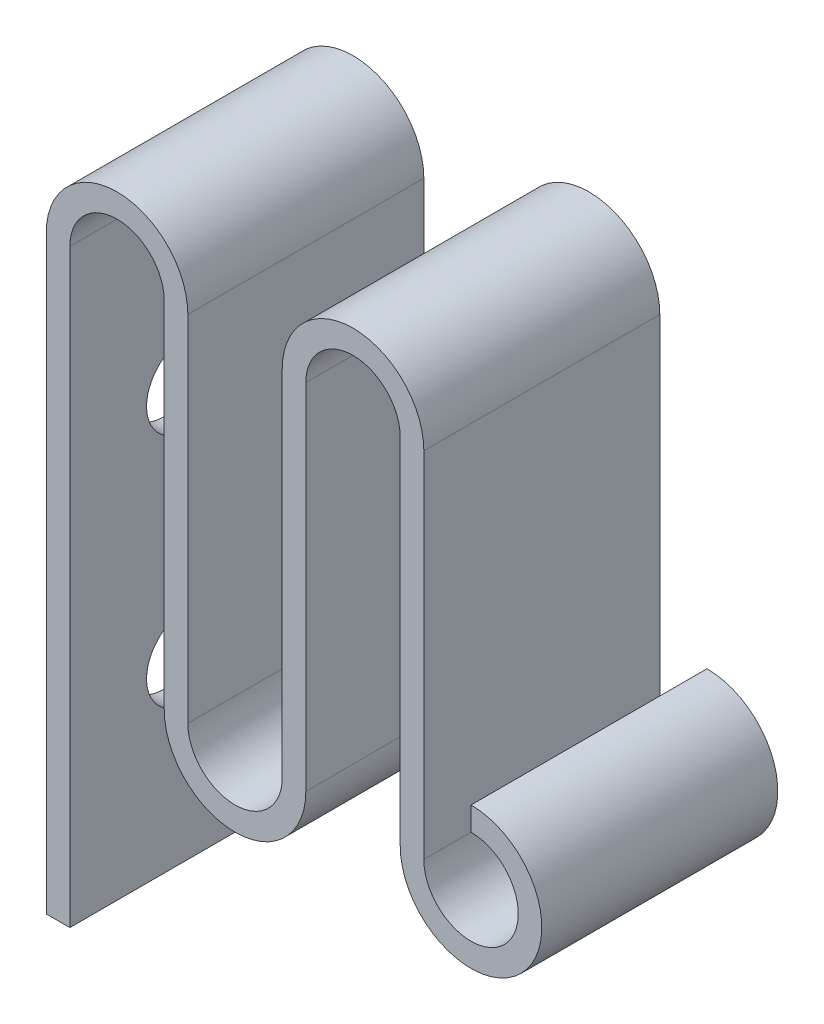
ISO-10303-21;
HEADER;
FILE_DESCRIPTION(('STEP AP214'),'2;1');
FILE_NAME('part.step','',(''),(''),'','','');
FILE_SCHEMA(('AUTOMOTIVE_DESIGN { 1 0 10303 214 1 1 1 1 }'));
ENDSEC;
DATA;
#1=APPLICATION_CONTEXT('core data for automotive mechanical design processes');
#2=APPLICATION_PROTOCOL_DEFINITION('international standard','automotive_design',2000,#1);
#3=PRODUCT_CONTEXT('',#1,'mechanical');
#4=PRODUCT('Part','Part','',(#3));
#5=PRODUCT_RELATED_PRODUCT_CATEGORY('part','',(#4));
#6=PRODUCT_DEFINITION_FORMATION('','',#4);
#7=PRODUCT_DEFINITION_CONTEXT('part definition',#1,'design');
#8=PRODUCT_DEFINITION('design','',#6,#7);
#9=PRODUCT_DEFINITION_SHAPE('','',#8);
#10=(LENGTH_UNIT() NAMED_UNIT(*) SI_UNIT(.MILLI.,.METRE.));
#11=(NAMED_UNIT(*) PLANE_ANGLE_UNIT() SI_UNIT($,.RADIAN.));
#12=(NAMED_UNIT(*) SI_UNIT($,.STERADIAN.) SOLID_ANGLE_UNIT());
#13=UNCERTAINTY_MEASURE_WITH_UNIT(LENGTH_MEASURE(1.E-05),#10,'distance_accuracy_value','');
#14=(GEOMETRIC_REPRESENTATION_CONTEXT(3) GLOBAL_UNCERTAINTY_ASSIGNED_CONTEXT((#13)) GLOBAL_UNIT_ASSIGNED_CONTEXT((#10,
#11,#12)) REPRESENTATION_CONTEXT('',''));
#15=CARTESIAN_POINT('',(0.,0.,0.));
#16=DIRECTION('',(0.,0.,1.));
#17=DIRECTION('',(1.,0.,0.));
#18=AXIS2_PLACEMENT_3D('',#15,#16,#17);
#19=CARTESIAN_POINT('',(10.,50.,0.));
#20=DIRECTION('',(-1.,0.,0.));
#21=DIRECTION('',(0.,-1.,0.));
#22=AXIS2_PLACEMENT_3D('',#19,#20,#21);
#23=PLANE('',#22);
#24=DIRECTION('',(0.,1.,0.));
#25=VECTOR('',#24,1.);
#26=CARTESIAN_POINT('',(10.,31.852298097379,20.));
#27=LINE('',#26,#25);
#28=CARTESIAN_POINT('',(10.,50.,20.));
#29=VERTEX_POINT('',#28);
#30=CARTESIAN_POINT('',(10.,20.,20.));
#31=VERTEX_POINT('',#30);
#32=EDGE_CURVE('E251',#29,#31,#27,.F.);
#33=ORIENTED_EDGE('',*,*,#32,.F.);
#34=DIRECTION('',(0.,0.,1.));
#35=VECTOR('',#34,1.);
#36=CARTESIAN_POINT('',(10.,50.,0.));
#37=LINE('',#36,#35);
#38=CARTESIAN_POINT('',(10.,50.,0.));
#39=VERTEX_POINT('',#38);
#40=EDGE_CURVE('E212',#29,#39,#37,.F.);
#41=ORIENTED_EDGE('',*,*,#40,.T.);
#42=DIRECTION('',(0.,1.,0.));
#43=VECTOR('',#42,1.);
#44=CARTESIAN_POINT('',(10.,31.852298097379,0.));
#45=LINE('',#44,#43);
#46=CARTESIAN_POINT('',(10.,20.,0.));
#47=VERTEX_POINT('',#46);
#48=EDGE_CURVE('E136',#39,#47,#45,.F.);
#49=ORIENTED_EDGE('',*,*,#48,.T.);
#50=DIRECTION('',(0.,0.,1.));
#51=VECTOR('',#50,1.);
#52=CARTESIAN_POINT('',(10.,20.,0.));
#53=LINE('',#52,#51);
#54=EDGE_CURVE('E146',#31,#47,#53,.F.);
#55=ORIENTED_EDGE('',*,*,#54,.F.);
#56=EDGE_LOOP('',(#33,#41,#49,#55));
#57=FACE_BOUND('',#56,.T.);
#58=ADVANCED_FACE('F15',(#57),#23,.T.);
#59=CARTESIAN_POINT('',(16.,20.,0.));
#60=DIRECTION('',(0.,0.,1.));
#61=DIRECTION('',(1.,0.,0.));
#62=AXIS2_PLACEMENT_3D('',#59,#60,#61);
#63=CYLINDRICAL_SURFACE('',#62,6.);
#64=CARTESIAN_POINT('',(16.,20.,20.));
#65=DIRECTION('',(0.,0.,1.));
#66=DIRECTION('',(1.,0.,0.));
#67=AXIS2_PLACEMENT_3D('',#64,#65,#66);
#68=CIRCLE('',#67,6.);
#69=CARTESIAN_POINT('',(22.,20.,20.));
#70=VERTEX_POINT('',#69);
#71=EDGE_CURVE('E249',#31,#70,#68,.T.);
#72=ORIENTED_EDGE('',*,*,#71,.F.);
#73=ORIENTED_EDGE('',*,*,#54,.T.);
#74=CARTESIAN_POINT('',(16.,20.,0.));
#75=DIRECTION('',(0.,0.,1.));
#76=DIRECTION('',(1.,0.,0.));
#77=AXIS2_PLACEMENT_3D('',#74,#75,#76);
#78=CIRCLE('',#77,6.);
#79=CARTESIAN_POINT('',(22.,20.,0.));
#80=VERTEX_POINT('',#79);
#81=EDGE_CURVE('E18',#47,#80,#78,.T.);
#82=ORIENTED_EDGE('',*,*,#81,.T.);
#83=DIRECTION('',(0.,0.,1.));
#84=VECTOR('',#83,1.);
#85=CARTESIAN_POINT('',(22.,20.,0.));
#86=LINE('',#85,#84);
#87=EDGE_CURVE('E144',#70,#80,#86,.F.);
#88=ORIENTED_EDGE('',*,*,#87,.F.);
#89=EDGE_LOOP('',(#72,#73,#82,#88));
#90=FACE_BOUND('',#89,.T.);
#91=ADVANCED_FACE('F143',(#90),#63,.T.);
#92=CARTESIAN_POINT('',(22.,20.,0.));
#93=DIRECTION('',(1.,0.,0.));
#94=DIRECTION('',(0.,1.,0.));
#95=AXIS2_PLACEMENT_3D('',#92,#93,#94);
#96=PLANE('',#95);
#97=DIRECTION('',(0.,1.,0.));
#98=VECTOR('',#97,1.);
#99=CARTESIAN_POINT('',(22.,31.852298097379,20.));
#100=LINE('',#99,#98);
#101=CARTESIAN_POINT('',(22.,50.,20.));
#102=VERTEX_POINT('',#101);
#103=EDGE_CURVE('E154',#70,#102,#100,.T.);
#104=ORIENTED_EDGE('',*,*,#103,.F.);
#105=ORIENTED_EDGE('',*,*,#87,.T.);
#106=DIRECTION('',(0.,1.,0.));
#107=VECTOR('',#106,1.);
#108=CARTESIAN_POINT('',(22.,31.852298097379,0.));
#109=LINE('',#108,#107);
#110=CARTESIAN_POINT('',(22.,50.,0.));
#111=VERTEX_POINT('',#110);
#112=EDGE_CURVE('E149',#80,#111,#109,.T.);
#113=ORIENTED_EDGE('',*,*,#112,.T.);
#114=DIRECTION('',(0.,0.,1.));
#115=VECTOR('',#114,1.);
#116=CARTESIAN_POINT('',(22.,50.,0.));
#117=LINE('',#116,#115);
#118=EDGE_CURVE('E156',#111,#102,#117,.T.);
#119=ORIENTED_EDGE('',*,*,#118,.T.);
#120=EDGE_LOOP('',(#104,#105,#113,#119));
#121=FACE_BOUND('',#120,.T.);
#122=ADVANCED_FACE('F151',(#121),#96,.T.);
#123=CARTESIAN_POINT('',(26.,50.,0.));
#124=DIRECTION('',(0.,0.,1.));
#125=DIRECTION('',(1.,0.,0.));
#126=AXIS2_PLACEMENT_3D('',#123,#124,#125);
#127=CYLINDRICAL_SURFACE('',#126,4.00000000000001);
#128=DIRECTION('',(0.,0.,1.));
#129=VECTOR('',#128,1.);
#130=CARTESIAN_POINT('',(30.,50.,0.));
#131=LINE('',#130,#129);
#132=CARTESIAN_POINT('',(30.,50.,20.));
#133=VERTEX_POINT('',#132);
#134=CARTESIAN_POINT('',(30.,50.,0.));
#135=VERTEX_POINT('',#134);
#136=EDGE_CURVE('E207',#133,#135,#131,.F.);
#137=ORIENTED_EDGE('',*,*,#136,.F.);
#138=CARTESIAN_POINT('',(26.,50.,20.));
#139=DIRECTION('',(0.,0.,1.));
#140=DIRECTION('',(1.,0.,0.));
#141=AXIS2_PLACEMENT_3D('',#138,#139,#140);
#142=CIRCLE('',#141,4.00000000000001);
#143=EDGE_CURVE('E246',#102,#133,#142,.F.);
#144=ORIENTED_EDGE('',*,*,#143,.F.);
#145=ORIENTED_EDGE('',*,*,#118,.F.);
#146=CARTESIAN_POINT('',(26.,50.,0.));
#147=DIRECTION('',(0.,0.,1.));
#148=DIRECTION('',(1.,0.,0.));
#149=AXIS2_PLACEMENT_3D('',#146,#147,#148);
#150=CIRCLE('',#149,4.00000000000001);
#151=EDGE_CURVE('E162',#111,#135,#150,.F.);
#152=ORIENTED_EDGE('',*,*,#151,.T.);
#153=EDGE_LOOP('',(#137,#144,#145,#152));
#154=FACE_BOUND('',#153,.T.);
#155=ADVANCED_FACE('F369',(#154),#127,.F.);
#156=CARTESIAN_POINT('',(30.,50.,0.));
#157=DIRECTION('',(-1.,0.,0.));
#158=DIRECTION('',(0.,-1.,0.));
#159=AXIS2_PLACEMENT_3D('',#156,#157,#158);
#160=PLANE('',#159);
#161=DIRECTION('',(0.,1.,0.));
#162=VECTOR('',#161,1.);
#163=CARTESIAN_POINT('',(30.,31.852298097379,20.));
#164=LINE('',#163,#162);
#165=CARTESIAN_POINT('',(30.,20.,20.));
#166=VERTEX_POINT('',#165);
#167=EDGE_CURVE('E245',#133,#166,#164,.F.);
#168=ORIENTED_EDGE('',*,*,#167,.F.);
#169=ORIENTED_EDGE('',*,*,#136,.T.);
#170=DIRECTION('',(0.,1.,0.));
#171=VECTOR('',#170,1.);
#172=CARTESIAN_POINT('',(30.,31.852298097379,0.));
#173=LINE('',#172,#171);
#174=CARTESIAN_POINT('',(30.,20.,0.));
#175=VERTEX_POINT('',#174);
#176=EDGE_CURVE('E164',#135,#175,#173,.F.);
#177=ORIENTED_EDGE('',*,*,#176,.T.);
#178=DIRECTION('',(0.,0.,1.));
#179=VECTOR('',#178,1.);
#180=CARTESIAN_POINT('',(30.0000000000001,20.,0.));
#181=LINE('',#180,#179);
#182=EDGE_CURVE('E204',#166,#175,#181,.F.);
#183=ORIENTED_EDGE('',*,*,#182,.F.);
#184=EDGE_LOOP('',(#168,#169,#177,#183));
#185=FACE_BOUND('',#184,.T.);
#186=ADVANCED_FACE('F274',(#185),#160,.T.);
#187=CARTESIAN_POINT('',(36.0000000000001,20.,0.));
#188=DIRECTION('',(0.,0.,1.));
#189=DIRECTION('',(1.,0.,0.));
#190=AXIS2_PLACEMENT_3D('',#187,#188,#189);
#191=CYLINDRICAL_SURFACE('',#190,6.);
#192=CARTESIAN_POINT('',(36.0000000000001,20.,20.));
#193=DIRECTION('',(0.,0.,1.));
#194=DIRECTION('',(1.,0.,0.));
#195=AXIS2_PLACEMENT_3D('',#192,#193,#194);
#196=CIRCLE('',#195,6.);
#197=CARTESIAN_POINT('',(36.0000000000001,26.,20.));
#198=VERTEX_POINT('',#197);
#199=EDGE_CURVE('E242',#166,#198,#196,.T.);
#200=ORIENTED_EDGE('',*,*,#199,.F.);
#201=ORIENTED_EDGE('',*,*,#182,.T.);
#202=CARTESIAN_POINT('',(36.0000000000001,20.,0.));
#203=DIRECTION('',(0.,0.,1.));
#204=DIRECTION('',(1.,0.,0.));
#205=AXIS2_PLACEMENT_3D('',#202,#203,#204);
#206=CIRCLE('',#205,6.);
#207=CARTESIAN_POINT('',(36.0000000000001,26.,0.));
#208=VERTEX_POINT('',#207);
#209=EDGE_CURVE('E269',#175,#208,#206,.T.);
#210=ORIENTED_EDGE('',*,*,#209,.T.);
#211=DIRECTION('',(0.,0.,1.));
#212=VECTOR('',#211,1.);
#213=CARTESIAN_POINT('',(36.0000000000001,26.,0.));
#214=LINE('',#213,#212);
#215=EDGE_CURVE('E201',#198,#208,#214,.F.);
#216=ORIENTED_EDGE('',*,*,#215,.F.);
#217=EDGE_LOOP('',(#200,#201,#210,#216));
#218=FACE_BOUND('',#217,.T.);
#219=ADVANCED_FACE('F276',(#218),#191,.T.);
#220=CARTESIAN_POINT('',(36.0000000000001,26.,0.));
#221=DIRECTION('',(-1.,0.,0.));
#222=DIRECTION('',(0.,-1.,0.));
#223=AXIS2_PLACEMENT_3D('',#220,#221,#222);
#224=PLANE('',#223);
#225=DIRECTION('',(0.,1.,0.));
#226=VECTOR('',#225,1.);
#227=CARTESIAN_POINT('',(36.0000000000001,31.852298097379,20.));
#228=LINE('',#227,#226);
#229=CARTESIAN_POINT('',(36.0000000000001,24.,20.));
#230=VERTEX_POINT('',#229);
#231=EDGE_CURVE('E241',#198,#230,#228,.F.);
#232=ORIENTED_EDGE('',*,*,#231,.F.);
#233=ORIENTED_EDGE('',*,*,#215,.T.);
#234=DIRECTION('',(0.,1.,0.));
#235=VECTOR('',#234,1.);
#236=CARTESIAN_POINT('',(36.0000000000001,31.852298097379,0.));
#237=LINE('',#236,#235);
#238=CARTESIAN_POINT('',(36.0000000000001,24.,0.));
#239=VERTEX_POINT('',#238);
#240=EDGE_CURVE('E268',#208,#239,#237,.F.);
#241=ORIENTED_EDGE('',*,*,#240,.T.);
#242=DIRECTION('',(0.,0.,1.));
#243=VECTOR('',#242,1.);
#244=CARTESIAN_POINT('',(36.0000000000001,24.,0.));
#245=LINE('',#244,#243);
#246=EDGE_CURVE('E199',#239,#230,#245,.T.);
#247=ORIENTED_EDGE('',*,*,#246,.T.);
#248=EDGE_LOOP('',(#232,#233,#241,#247));
#249=FACE_BOUND('',#248,.T.);
#250=ADVANCED_FACE('F284',(#249),#224,.T.);
#251=CARTESIAN_POINT('',(36.0000000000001,20.,0.));
#252=DIRECTION('',(0.,0.,1.));
#253=DIRECTION('',(1.,0.,0.));
#254=AXIS2_PLACEMENT_3D('',#251,#252,#253);
#255=CYLINDRICAL_SURFACE('',#254,4.00000000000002);
#256=DIRECTION('',(0.,0.,1.));
#257=VECTOR('',#256,1.);
#258=CARTESIAN_POINT('',(32.,20.,0.));
#259=LINE('',#258,#257);
#260=CARTESIAN_POINT('',(32.,20.,20.));
#261=VERTEX_POINT('',#260);
#262=CARTESIAN_POINT('',(32.,20.,0.));
#263=VERTEX_POINT('',#262);
#264=EDGE_CURVE('E196',#261,#263,#259,.F.);
#265=ORIENTED_EDGE('',*,*,#264,.F.);
#266=CARTESIAN_POINT('',(36.0000000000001,20.,20.));
#267=DIRECTION('',(0.,0.,1.));
#268=DIRECTION('',(1.,0.,0.));
#269=AXIS2_PLACEMENT_3D('',#266,#267,#268);
#270=CIRCLE('',#269,4.00000000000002);
#271=EDGE_CURVE('E238',#230,#261,#270,.F.);
#272=ORIENTED_EDGE('',*,*,#271,.F.);
#273=ORIENTED_EDGE('',*,*,#246,.F.);
#274=CARTESIAN_POINT('',(36.0000000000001,20.,0.));
#275=DIRECTION('',(0.,0.,1.));
#276=DIRECTION('',(1.,0.,0.));
#277=AXIS2_PLACEMENT_3D('',#274,#275,#276);
#278=CIRCLE('',#277,4.00000000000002);
#279=EDGE_CURVE('E266',#239,#263,#278,.F.);
#280=ORIENTED_EDGE('',*,*,#279,.T.);
#281=EDGE_LOOP('',(#265,#272,#273,#280));
#282=FACE_BOUND('',#281,.T.);
#283=ADVANCED_FACE('F287',(#282),#255,.F.);
#284=CARTESIAN_POINT('',(32.,20.,0.));
#285=DIRECTION('',(1.,0.,0.));
#286=DIRECTION('',(0.,1.,0.));
#287=AXIS2_PLACEMENT_3D('',#284,#285,#286);
#288=PLANE('',#287);
#289=DIRECTION('',(0.,1.,0.));
#290=VECTOR('',#289,1.);
#291=CARTESIAN_POINT('',(32.,31.852298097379,20.));
#292=LINE('',#291,#290);
#293=CARTESIAN_POINT('',(32.,50.,20.));
#294=VERTEX_POINT('',#293);
#295=EDGE_CURVE('E237',#261,#294,#292,.T.);
#296=ORIENTED_EDGE('',*,*,#295,.F.);
#297=ORIENTED_EDGE('',*,*,#264,.T.);
#298=DIRECTION('',(0.,1.,0.));
#299=VECTOR('',#298,1.);
#300=CARTESIAN_POINT('',(32.,31.852298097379,0.));
#301=LINE('',#300,#299);
#302=CARTESIAN_POINT('',(32.,50.,0.));
#303=VERTEX_POINT('',#302);
#304=EDGE_CURVE('E265',#263,#303,#301,.T.);
#305=ORIENTED_EDGE('',*,*,#304,.T.);
#306=DIRECTION('',(0.,0.,1.));
#307=VECTOR('',#306,1.);
#308=CARTESIAN_POINT('',(32.,50.,0.));
#309=LINE('',#308,#307);
#310=EDGE_CURVE('E193',#294,#303,#309,.F.);
#311=ORIENTED_EDGE('',*,*,#310,.F.);
#312=EDGE_LOOP('',(#296,#297,#305,#311));
#313=FACE_BOUND('',#312,.T.);
#314=ADVANCED_FACE('F329',(#313),#288,.T.);
#315=CARTESIAN_POINT('',(26.,50.,0.));
#316=DIRECTION('',(0.,0.,1.));
#317=DIRECTION('',(1.,0.,0.));
#318=AXIS2_PLACEMENT_3D('',#315,#316,#317);
#319=CYLINDRICAL_SURFACE('',#318,6.);
#320=CARTESIAN_POINT('',(26.,50.,20.));
#321=DIRECTION('',(0.,0.,1.));
#322=DIRECTION('',(1.,0.,0.));
#323=AXIS2_PLACEMENT_3D('',#320,#321,#322);
#324=CIRCLE('',#323,6.);
#325=CARTESIAN_POINT('',(20.,50.,20.));
#326=VERTEX_POINT('',#325);
#327=EDGE_CURVE('E234',#294,#326,#324,.T.);
#328=ORIENTED_EDGE('',*,*,#327,.F.);
#329=ORIENTED_EDGE('',*,*,#310,.T.);
#330=CARTESIAN_POINT('',(26.,50.,0.));
#331=DIRECTION('',(0.,0.,1.));
#332=DIRECTION('',(1.,0.,0.));
#333=AXIS2_PLACEMENT_3D('',#330,#331,#332);
#334=CIRCLE('',#333,6.);
#335=CARTESIAN_POINT('',(20.,50.,0.));
#336=VERTEX_POINT('',#335);
#337=EDGE_CURVE('E263',#303,#336,#334,.T.);
#338=ORIENTED_EDGE('',*,*,#337,.T.);
#339=DIRECTION('',(0.,0.,1.));
#340=VECTOR('',#339,1.);
#341=CARTESIAN_POINT('',(20.,50.,0.));
#342=LINE('',#341,#340);
#343=EDGE_CURVE('E190',#326,#336,#342,.F.);
#344=ORIENTED_EDGE('',*,*,#343,.F.);
#345=EDGE_LOOP('',(#328,#329,#338,#344));
#346=FACE_BOUND('',#345,.T.);
#347=ADVANCED_FACE('F333',(#346),#319,.T.);
#348=CARTESIAN_POINT('',(20.,50.,0.));
#349=DIRECTION('',(-1.,0.,0.));
#350=DIRECTION('',(0.,-1.,0.));
#351=AXIS2_PLACEMENT_3D('',#348,#349,#350);
#352=PLANE('',#351);
#353=DIRECTION('',(0.,1.,0.));
#354=VECTOR('',#353,1.);
#355=CARTESIAN_POINT('',(20.,31.852298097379,20.));
#356=LINE('',#355,#354);
#357=CARTESIAN_POINT('',(20.,20.,20.));
#358=VERTEX_POINT('',#357);
#359=EDGE_CURVE('E233',#326,#358,#356,.F.);
#360=ORIENTED_EDGE('',*,*,#359,.F.);
#361=ORIENTED_EDGE('',*,*,#343,.T.);
#362=DIRECTION('',(0.,1.,0.));
#363=VECTOR('',#362,1.);
#364=CARTESIAN_POINT('',(20.,31.852298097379,0.));
#365=LINE('',#364,#363);
#366=CARTESIAN_POINT('',(20.,20.,0.));
#367=VERTEX_POINT('',#366);
#368=EDGE_CURVE('E262',#336,#367,#365,.F.);
#369=ORIENTED_EDGE('',*,*,#368,.T.);
#370=DIRECTION('',(0.,0.,1.));
#371=VECTOR('',#370,1.);
#372=CARTESIAN_POINT('',(20.,20.,0.));
#373=LINE('',#372,#371);
#374=EDGE_CURVE('E188',#367,#358,#373,.T.);
#375=ORIENTED_EDGE('',*,*,#374,.T.);
#376=EDGE_LOOP('',(#360,#361,#369,#375));
#377=FACE_BOUND('',#376,.T.);
#378=ADVANCED_FACE('F340',(#377),#352,.T.);
#379=CARTESIAN_POINT('',(16.,20.,0.));
#380=DIRECTION('',(0.,0.,1.));
#381=DIRECTION('',(1.,0.,0.));
#382=AXIS2_PLACEMENT_3D('',#379,#380,#381);
#383=CYLINDRICAL_SURFACE('',#382,4.00000000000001);
#384=DIRECTION('',(0.,0.,1.));
#385=VECTOR('',#384,1.);
#386=CARTESIAN_POINT('',(12.,20.,0.));
#387=LINE('',#386,#385);
#388=CARTESIAN_POINT('',(12.,20.,20.));
#389=VERTEX_POINT('',#388);
#390=CARTESIAN_POINT('',(12.,20.,0.));
#391=VERTEX_POINT('',#390);
#392=EDGE_CURVE('E185',#389,#391,#387,.F.);
#393=ORIENTED_EDGE('',*,*,#392,.F.);
#394=CARTESIAN_POINT('',(16.,20.,20.));
#395=DIRECTION('',(0.,0.,1.));
#396=DIRECTION('',(1.,0.,0.));
#397=AXIS2_PLACEMENT_3D('',#394,#395,#396);
#398=CIRCLE('',#397,4.00000000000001);
#399=EDGE_CURVE('E230',#358,#389,#398,.F.);
#400=ORIENTED_EDGE('',*,*,#399,.F.);
#401=ORIENTED_EDGE('',*,*,#374,.F.);
#402=CARTESIAN_POINT('',(16.,20.,0.));
#403=DIRECTION('',(0.,0.,1.));
#404=DIRECTION('',(1.,0.,0.));
#405=AXIS2_PLACEMENT_3D('',#402,#403,#404);
#406=CIRCLE('',#405,4.00000000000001);
#407=EDGE_CURVE('E260',#367,#391,#406,.F.);
#408=ORIENTED_EDGE('',*,*,#407,.T.);
#409=EDGE_LOOP('',(#393,#400,#401,#408));
#410=FACE_BOUND('',#409,.T.);
#411=ADVANCED_FACE('F343',(#410),#383,.F.);
#412=CARTESIAN_POINT('',(12.,20.,0.));
#413=DIRECTION('',(1.,0.,0.));
#414=DIRECTION('',(0.,1.,0.));
#415=AXIS2_PLACEMENT_3D('',#412,#413,#414);
#416=PLANE('',#415);
#417=DIRECTION('',(0.,1.,0.));
#418=VECTOR('',#417,1.);
#419=CARTESIAN_POINT('',(12.,31.852298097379,20.));
#420=LINE('',#419,#418);
#421=CARTESIAN_POINT('',(12.,50.,20.));
#422=VERTEX_POINT('',#421);
#423=EDGE_CURVE('E229',#389,#422,#420,.T.);
#424=ORIENTED_EDGE('',*,*,#423,.F.);
#425=ORIENTED_EDGE('',*,*,#392,.T.);
#426=DIRECTION('',(0.,1.,0.));
#427=VECTOR('',#426,1.);
#428=CARTESIAN_POINT('',(12.,31.852298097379,0.));
#429=LINE('',#428,#427);
#430=CARTESIAN_POINT('',(12.,50.,0.));
#431=VERTEX_POINT('',#430);
#432=EDGE_CURVE('E259',#391,#431,#429,.T.);
#433=ORIENTED_EDGE('',*,*,#432,.T.);
#434=DIRECTION('',(0.,0.,1.));
#435=VECTOR('',#434,1.);
#436=CARTESIAN_POINT('',(12.,50.,0.));
#437=LINE('',#436,#435);
#438=EDGE_CURVE('E182',#422,#431,#437,.F.);
#439=ORIENTED_EDGE('',*,*,#438,.F.);
#440=EDGE_LOOP('',(#424,#425,#433,#439));
#441=FACE_BOUND('',#440,.T.);
#442=ADVANCED_FACE('F349',(#441),#416,.T.);
#443=CARTESIAN_POINT('',(6.,50.,0.));
#444=DIRECTION('',(0.,0.,1.));
#445=DIRECTION('',(1.,0.,0.));
#446=AXIS2_PLACEMENT_3D('',#443,#444,#445);
#447=CYLINDRICAL_SURFACE('',#446,6.);
#448=CARTESIAN_POINT('',(6.,50.,20.));
#449=DIRECTION('',(0.,0.,1.));
#450=DIRECTION('',(1.,0.,0.));
#451=AXIS2_PLACEMENT_3D('',#448,#449,#450);
#452=CIRCLE('',#451,6.);
#453=CARTESIAN_POINT('',(0.,50.,20.));
#454=VERTEX_POINT('',#453);
#455=EDGE_CURVE('E173',#422,#454,#452,.T.);
#456=ORIENTED_EDGE('',*,*,#455,.F.);
#457=ORIENTED_EDGE('',*,*,#438,.T.);
#458=CARTESIAN_POINT('',(6.,50.,0.));
#459=DIRECTION('',(0.,0.,1.));
#460=DIRECTION('',(1.,0.,0.));
#461=AXIS2_PLACEMENT_3D('',#458,#459,#460);
#462=CIRCLE('',#461,6.);
#463=CARTESIAN_POINT('',(0.,50.,0.));
#464=VERTEX_POINT('',#463);
#465=EDGE_CURVE('E257',#431,#464,#462,.T.);
#466=ORIENTED_EDGE('',*,*,#465,.T.);
#467=DIRECTION('',(0.,0.,1.));
#468=VECTOR('',#467,1.);
#469=CARTESIAN_POINT('',(0.,50.,0.));
#470=LINE('',#469,#468);
#471=EDGE_CURVE('E169',#454,#464,#470,.F.);
#472=ORIENTED_EDGE('',*,*,#471,.F.);
#473=EDGE_LOOP('',(#456,#457,#466,#472));
#474=FACE_BOUND('',#473,.T.);
#475=ADVANCED_FACE('F351',(#474),#447,.T.);
#476=CARTESIAN_POINT('',(0.,50.,0.));
#477=DIRECTION('',(-1.,0.,0.));
#478=DIRECTION('',(0.,0.,1.));
#479=AXIS2_PLACEMENT_3D('',#476,#477,#478);
#480=PLANE('',#479);
#481=CARTESIAN_POINT('',(0.,15.,10.));
#482=DIRECTION('',(-1.,0.,0.));
#483=DIRECTION('',(0.,0.,1.));
#484=AXIS2_PLACEMENT_3D('',#481,#482,#483);
#485=CIRCLE('',#484,3.5);
#486=CARTESIAN_POINT('',(0.,15.,13.5));
#487=VERTEX_POINT('',#486);
#488=EDGE_CURVE('E221',#487,#487,#485,.F.);
#489=ORIENTED_EDGE('',*,*,#488,.T.);
#490=EDGE_LOOP('',(#489));
#491=FACE_BOUND('',#490,.T.);
#492=CARTESIAN_POINT('',(0.,35.,10.));
#493=DIRECTION('',(-1.,0.,0.));
#494=DIRECTION('',(0.,0.,1.));
#495=AXIS2_PLACEMENT_3D('',#492,#493,#494);
#496=CIRCLE('',#495,3.5);
#497=CARTESIAN_POINT('',(0.,35.,13.5));
#498=VERTEX_POINT('',#497);
#499=EDGE_CURVE('E179',#498,#498,#496,.F.);
#500=ORIENTED_EDGE('',*,*,#499,.T.);
#501=EDGE_LOOP('',(#500));
#502=FACE_BOUND('',#501,.T.);
#503=DIRECTION('',(0.,1.,0.));
#504=VECTOR('',#503,1.);
#505=CARTESIAN_POINT('',(0.,31.852298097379,20.));
#506=LINE('',#505,#504);
#507=CARTESIAN_POINT('',(0.,0.,20.));
#508=VERTEX_POINT('',#507);
#509=EDGE_CURVE('E255',#454,#508,#506,.F.);
#510=ORIENTED_EDGE('',*,*,#509,.F.);
#511=ORIENTED_EDGE('',*,*,#471,.T.);
#512=DIRECTION('',(0.,1.,0.));
#513=VECTOR('',#512,1.);
#514=CARTESIAN_POINT('',(0.,31.852298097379,0.));
#515=LINE('',#514,#513);
#516=CARTESIAN_POINT('',(0.,0.,0.));
#517=VERTEX_POINT('',#516);
#518=EDGE_CURVE('E215',#464,#517,#515,.F.);
#519=ORIENTED_EDGE('',*,*,#518,.T.);
#520=DIRECTION('',(0.,0.,-1.));
#521=VECTOR('',#520,1.);
#522=CARTESIAN_POINT('',(0.,0.,0.));
#523=LINE('',#522,#521);
#524=EDGE_CURVE('E176',#508,#517,#523,.T.);
#525=ORIENTED_EDGE('',*,*,#524,.F.);
#526=EDGE_LOOP('',(#510,#511,#519,#525));
#527=FACE_BOUND('',#526,.T.);
#528=ADVANCED_FACE('F356',(#491,#502,#527),#480,.T.);
#529=CARTESIAN_POINT('',(16.3996073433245,31.852298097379,0.));
#530=DIRECTION('',(0.,0.,1.));
#531=DIRECTION('',(1.,0.,0.));
#532=AXIS2_PLACEMENT_3D('',#529,#530,#531);
#533=PLANE('',#532);
#534=ORIENTED_EDGE('',*,*,#465,.F.);
#535=ORIENTED_EDGE('',*,*,#432,.F.);
#536=ORIENTED_EDGE('',*,*,#407,.F.);
#537=ORIENTED_EDGE('',*,*,#368,.F.);
#538=ORIENTED_EDGE('',*,*,#337,.F.);
#539=ORIENTED_EDGE('',*,*,#304,.F.);
#540=ORIENTED_EDGE('',*,*,#279,.F.);
#541=ORIENTED_EDGE('',*,*,#240,.F.);
#542=ORIENTED_EDGE('',*,*,#209,.F.);
#543=ORIENTED_EDGE('',*,*,#176,.F.);
#544=ORIENTED_EDGE('',*,*,#151,.F.);
#545=ORIENTED_EDGE('',*,*,#112,.F.);
#546=ORIENTED_EDGE('',*,*,#81,.F.);
#547=ORIENTED_EDGE('',*,*,#48,.F.);
#548=CARTESIAN_POINT('',(6.,50.,0.));
#549=DIRECTION('',(0.,0.,1.));
#550=DIRECTION('',(1.,0.,0.));
#551=AXIS2_PLACEMENT_3D('',#548,#549,#550);
#552=CIRCLE('',#551,4.00000000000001);
#553=CARTESIAN_POINT('',(1.99999999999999,50.,0.));
#554=VERTEX_POINT('',#553);
#555=EDGE_CURVE('E214',#39,#554,#552,.T.);
#556=ORIENTED_EDGE('',*,*,#555,.T.);
#557=DIRECTION('',(0.,1.,0.));
#558=VECTOR('',#557,1.);
#559=CARTESIAN_POINT('',(2.,0.,0.));
#560=LINE('',#559,#558);
#561=CARTESIAN_POINT('',(2.,0.,0.));
#562=VERTEX_POINT('',#561);
#563=EDGE_CURVE('E224',#562,#554,#560,.T.);
#564=ORIENTED_EDGE('',*,*,#563,.F.);
#565=DIRECTION('',(1.,0.,0.));
#566=VECTOR('',#565,1.);
#567=CARTESIAN_POINT('',(0.,0.,0.));
#568=LINE('',#567,#566);
#569=EDGE_CURVE('E170',#517,#562,#568,.T.);
#570=ORIENTED_EDGE('',*,*,#569,.F.);
#571=ORIENTED_EDGE('',*,*,#518,.F.);
#572=EDGE_LOOP('',(#534,#535,#536,#537,#538,#539,#540,#541,#542,#543,#544,#545,#546,#547,#556,
#564,#570,#571));
#573=FACE_BOUND('',#572,.T.);
#574=ADVANCED_FACE('F160',(#573),#533,.F.);
#575=CARTESIAN_POINT('',(6.,50.,0.));
#576=DIRECTION('',(0.,0.,1.));
#577=DIRECTION('',(1.,0.,0.));
#578=AXIS2_PLACEMENT_3D('',#575,#576,#577);
#579=CYLINDRICAL_SURFACE('',#578,4.00000000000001);
#580=ORIENTED_EDGE('',*,*,#40,.F.);
#581=CARTESIAN_POINT('',(6.,50.,20.));
#582=DIRECTION('',(0.,0.,1.));
#583=DIRECTION('',(1.,0.,0.));
#584=AXIS2_PLACEMENT_3D('',#581,#582,#583);
#585=CIRCLE('',#584,4.00000000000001);
#586=CARTESIAN_POINT('',(1.99999999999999,50.,20.));
#587=VERTEX_POINT('',#586);
#588=EDGE_CURVE('E252',#587,#29,#585,.F.);
#589=ORIENTED_EDGE('',*,*,#588,.F.);
#590=DIRECTION('',(0.,0.,1.));
#591=VECTOR('',#590,1.);
#592=CARTESIAN_POINT('',(1.99999999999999,50.,0.));
#593=LINE('',#592,#591);
#594=EDGE_CURVE('E304',#554,#587,#593,.T.);
#595=ORIENTED_EDGE('',*,*,#594,.F.);
#596=ORIENTED_EDGE('',*,*,#555,.F.);
#597=EDGE_LOOP('',(#580,#589,#595,#596));
#598=FACE_BOUND('',#597,.T.);
#599=ADVANCED_FACE('F365',(#598),#579,.F.);
#600=CARTESIAN_POINT('',(16.3996073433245,31.852298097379,20.));
#601=DIRECTION('',(0.,0.,1.));
#602=DIRECTION('',(1.,0.,0.));
#603=AXIS2_PLACEMENT_3D('',#600,#601,#602);
#604=PLANE('',#603);
#605=ORIENTED_EDGE('',*,*,#423,.T.);
#606=ORIENTED_EDGE('',*,*,#455,.T.);
#607=ORIENTED_EDGE('',*,*,#509,.T.);
#608=DIRECTION('',(1.,0.,0.));
#609=VECTOR('',#608,1.);
#610=CARTESIAN_POINT('',(0.,0.,20.));
#611=LINE('',#610,#609);
#612=CARTESIAN_POINT('',(2.,0.,20.));
#613=VERTEX_POINT('',#612);
#614=EDGE_CURVE('E33',#613,#508,#611,.F.);
#615=ORIENTED_EDGE('',*,*,#614,.F.);
#616=DIRECTION('',(0.,1.,0.));
#617=VECTOR('',#616,1.);
#618=CARTESIAN_POINT('',(2.,0.,20.));
#619=LINE('',#618,#617);
#620=EDGE_CURVE('E307',#587,#613,#619,.F.);
#621=ORIENTED_EDGE('',*,*,#620,.F.);
#622=ORIENTED_EDGE('',*,*,#588,.T.);
#623=ORIENTED_EDGE('',*,*,#32,.T.);
#624=ORIENTED_EDGE('',*,*,#71,.T.);
#625=ORIENTED_EDGE('',*,*,#103,.T.);
#626=ORIENTED_EDGE('',*,*,#143,.T.);
#627=ORIENTED_EDGE('',*,*,#167,.T.);
#628=ORIENTED_EDGE('',*,*,#199,.T.);
#629=ORIENTED_EDGE('',*,*,#231,.T.);
#630=ORIENTED_EDGE('',*,*,#271,.T.);
#631=ORIENTED_EDGE('',*,*,#295,.T.);
#632=ORIENTED_EDGE('',*,*,#327,.T.);
#633=ORIENTED_EDGE('',*,*,#359,.T.);
#634=ORIENTED_EDGE('',*,*,#399,.T.);
#635=EDGE_LOOP('',(#605,#606,#607,#615,#621,#622,#623,#624,#625,#626,#627,#628,#629,#630,#631,
#632,#633,#634));
#636=FACE_BOUND('',#635,.T.);
#637=ADVANCED_FACE('F292',(#636),#604,.T.);
#638=CARTESIAN_POINT('',(0.,0.,0.));
#639=DIRECTION('',(0.,-1.,0.));
#640=DIRECTION('',(0.,0.,-1.));
#641=AXIS2_PLACEMENT_3D('',#638,#639,#640);
#642=PLANE('',#641);
#643=ORIENTED_EDGE('',*,*,#614,.T.);
#644=ORIENTED_EDGE('',*,*,#524,.T.);
#645=ORIENTED_EDGE('',*,*,#569,.T.);
#646=DIRECTION('',(0.,0.,1.));
#647=VECTOR('',#646,1.);
#648=CARTESIAN_POINT('',(2.,0.,0.));
#649=LINE('',#648,#647);
#650=EDGE_CURVE('E220',#613,#562,#649,.F.);
#651=ORIENTED_EDGE('',*,*,#650,.F.);
#652=EDGE_LOOP('',(#643,#644,#645,#651));
#653=FACE_BOUND('',#652,.T.);
#654=ADVANCED_FACE('F359',(#653),#642,.T.);
#655=CARTESIAN_POINT('',(1.5,35.,10.));
#656=DIRECTION('',(-1.,0.,0.));
#657=DIRECTION('',(0.,0.,1.));
#658=AXIS2_PLACEMENT_3D('',#655,#656,#657);
#659=CYLINDRICAL_SURFACE('',#658,3.5);
#660=ORIENTED_EDGE('',*,*,#499,.F.);
#661=EDGE_LOOP('',(#660));
#662=FACE_BOUND('',#661,.T.);
#663=CARTESIAN_POINT('',(2.,35.,10.));
#664=DIRECTION('',(-1.,0.,0.));
#665=DIRECTION('',(0.,0.,1.));
#666=AXIS2_PLACEMENT_3D('',#663,#664,#665);
#667=CIRCLE('',#666,3.5);
#668=CARTESIAN_POINT('',(2.,35.,13.5));
#669=VERTEX_POINT('',#668);
#670=EDGE_CURVE('E24',#669,#669,#667,.T.);
#671=ORIENTED_EDGE('',*,*,#670,.F.);
#672=EDGE_LOOP('',(#671));
#673=FACE_BOUND('',#672,.T.);
#674=ADVANCED_FACE('F386',(#662,#673),#659,.F.);
#675=CARTESIAN_POINT('',(1.5,15.,10.));
#676=DIRECTION('',(-1.,0.,0.));
#677=DIRECTION('',(0.,0.,1.));
#678=AXIS2_PLACEMENT_3D('',#675,#676,#677);
#679=CYLINDRICAL_SURFACE('',#678,3.5);
#680=ORIENTED_EDGE('',*,*,#488,.F.);
#681=EDGE_LOOP('',(#680));
#682=FACE_BOUND('',#681,.T.);
#683=CARTESIAN_POINT('',(2.,15.,10.));
#684=DIRECTION('',(-1.,0.,0.));
#685=DIRECTION('',(0.,0.,1.));
#686=AXIS2_PLACEMENT_3D('',#683,#684,#685);
#687=CIRCLE('',#686,3.5);
#688=CARTESIAN_POINT('',(2.,15.,13.5));
#689=VERTEX_POINT('',#688);
#690=EDGE_CURVE('E9',#689,#689,#687,.T.);
#691=ORIENTED_EDGE('',*,*,#690,.F.);
#692=EDGE_LOOP('',(#691));
#693=FACE_BOUND('',#692,.T.);
#694=ADVANCED_FACE('F380',(#682,#693),#679,.F.);
#695=CARTESIAN_POINT('',(2.,0.,0.));
#696=DIRECTION('',(1.,0.,0.));
#697=DIRECTION('',(0.,1.,0.));
#698=AXIS2_PLACEMENT_3D('',#695,#696,#697);
#699=PLANE('',#698);
#700=ORIENTED_EDGE('',*,*,#690,.T.);
#701=EDGE_LOOP('',(#700));
#702=FACE_BOUND('',#701,.T.);
#703=ORIENTED_EDGE('',*,*,#670,.T.);
#704=EDGE_LOOP('',(#703));
#705=FACE_BOUND('',#704,.T.);
#706=ORIENTED_EDGE('',*,*,#620,.T.);
#707=ORIENTED_EDGE('',*,*,#650,.T.);
#708=ORIENTED_EDGE('',*,*,#563,.T.);
#709=ORIENTED_EDGE('',*,*,#594,.T.);
#710=EDGE_LOOP('',(#706,#707,#708,#709));
#711=FACE_BOUND('',#710,.T.);
#712=ADVANCED_FACE('F361',(#702,#705,#711),#699,.T.);
#713=CLOSED_SHELL('',(#58,#91,#122,#155,#186,#219,#250,#283,#314,#347,#378,#411,#442,#475,#528,
#574,#599,#637,#654,#674,#694,#712));
#714=MANIFOLD_SOLID_BREP('B1',#713);
#715=ADVANCED_BREP_SHAPE_REPRESENTATION('',(#18,#714),#14);
#716=SHAPE_DEFINITION_REPRESENTATION(#9,#715);
ENDSEC;
END-ISO-10303-21;
